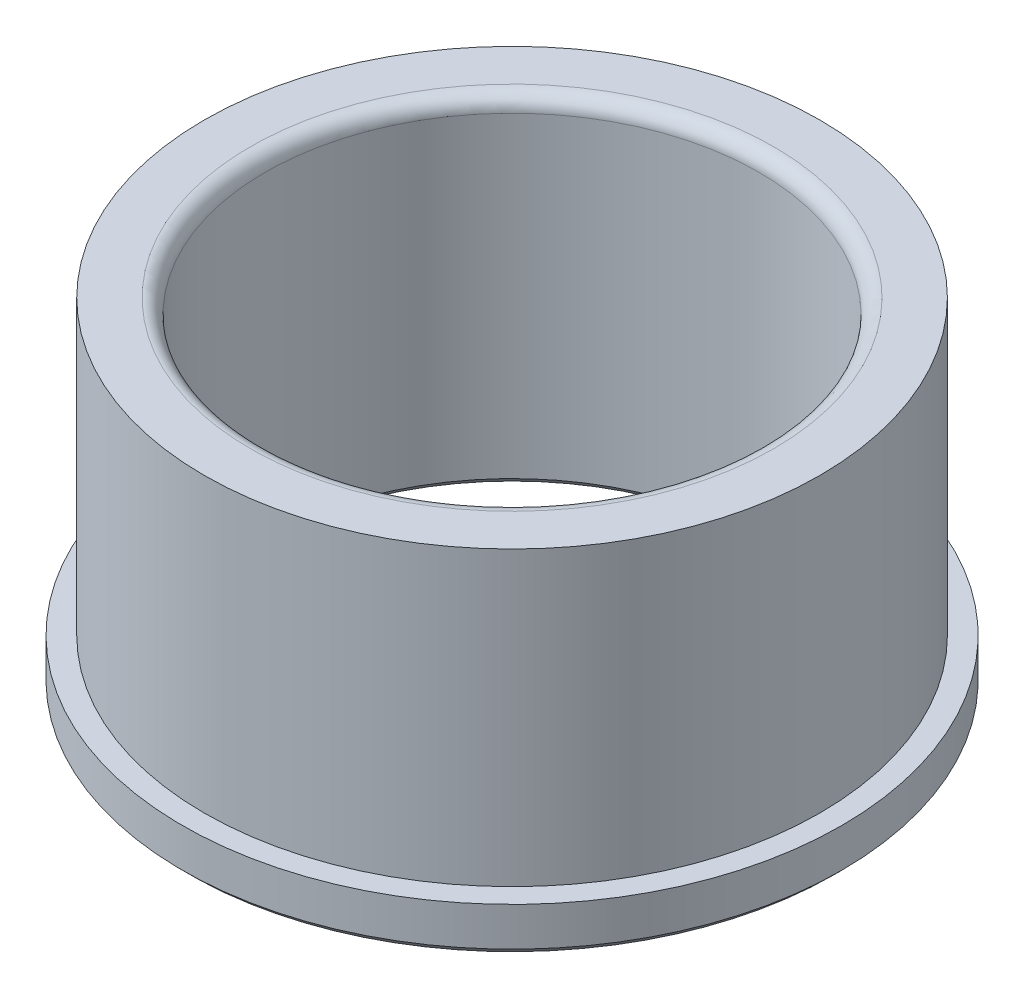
ISO-10303-21;
HEADER;
FILE_DESCRIPTION(('STEP AP214'),'2;1');
FILE_NAME('part.step','',(''),(''),'','','');
FILE_SCHEMA(('AUTOMOTIVE_DESIGN { 1 0 10303 214 1 1 1 1 }'));
ENDSEC;
DATA;
#1=APPLICATION_CONTEXT('core data for automotive mechanical design processes');
#2=APPLICATION_PROTOCOL_DEFINITION('international standard','automotive_design',2000,#1);
#3=PRODUCT_CONTEXT('',#1,'mechanical');
#4=PRODUCT('Part','Part','',(#3));
#5=PRODUCT_RELATED_PRODUCT_CATEGORY('part','',(#4));
#6=PRODUCT_DEFINITION_FORMATION('','',#4);
#7=PRODUCT_DEFINITION_CONTEXT('part definition',#1,'design');
#8=PRODUCT_DEFINITION('design','',#6,#7);
#9=PRODUCT_DEFINITION_SHAPE('','',#8);
#10=(LENGTH_UNIT() NAMED_UNIT(*) SI_UNIT(.MILLI.,.METRE.));
#11=(NAMED_UNIT(*) PLANE_ANGLE_UNIT() SI_UNIT($,.RADIAN.));
#12=(NAMED_UNIT(*) SI_UNIT($,.STERADIAN.) SOLID_ANGLE_UNIT());
#13=UNCERTAINTY_MEASURE_WITH_UNIT(LENGTH_MEASURE(1.E-05),#10,'distance_accuracy_value','');
#14=(GEOMETRIC_REPRESENTATION_CONTEXT(3) GLOBAL_UNCERTAINTY_ASSIGNED_CONTEXT((#13)) GLOBAL_UNIT_ASSIGNED_CONTEXT((#10,
#11,#12)) REPRESENTATION_CONTEXT('',''));
#15=CARTESIAN_POINT('',(0.,0.,0.));
#16=DIRECTION('',(0.,0.,1.));
#17=DIRECTION('',(1.,0.,0.));
#18=AXIS2_PLACEMENT_3D('',#15,#16,#17);
#19=CARTESIAN_POINT('',(3.49148336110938E-12,-1000.,0.));
#20=DIRECTION('',(0.,-1.,0.));
#21=DIRECTION('',(1.,0.,0.));
#22=AXIS2_PLACEMENT_3D('',#19,#20,#21);
#23=CYLINDRICAL_SURFACE('',#22,31.7563499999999);
#24=CARTESIAN_POINT('',(0.,4.7625,0.));
#25=DIRECTION('',(0.,-1.,0.));
#26=DIRECTION('',(1.,0.,0.));
#27=AXIS2_PLACEMENT_3D('',#24,#25,#26);
#28=CIRCLE('',#27,31.75635);
#29=CARTESIAN_POINT('',(31.75635,4.76250000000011,0.));
#30=VERTEX_POINT('',#29);
#31=EDGE_CURVE('E39',#30,#30,#28,.T.);
#32=ORIENTED_EDGE('',*,*,#31,.F.);
#33=EDGE_LOOP('',(#32));
#34=FACE_BOUND('',#33,.T.);
#35=CARTESIAN_POINT('',(-1.21940056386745E-13,34.9250000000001,0.));
#36=DIRECTION('',(0.,-1.,0.));
#37=DIRECTION('',(1.,0.,0.));
#38=AXIS2_PLACEMENT_3D('',#35,#36,#37);
#39=CIRCLE('',#38,31.7563499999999);
#40=CARTESIAN_POINT('',(31.7563499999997,34.9250000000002,0.));
#41=VERTEX_POINT('',#40);
#42=EDGE_CURVE('E60',#41,#41,#39,.T.);
#43=ORIENTED_EDGE('',*,*,#42,.T.);
#44=EDGE_LOOP('',(#43));
#45=FACE_BOUND('',#44,.T.);
#46=ADVANCED_FACE('F28',(#34,#45),#23,.T.);
#47=CARTESIAN_POINT('',(-33.9979,4.76249999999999,0.));
#48=DIRECTION('',(0.,-1.,0.));
#49=DIRECTION('',(1.,0.,0.));
#50=AXIS2_PLACEMENT_3D('',#47,#48,#49);
#51=PLANE('',#50);
#52=CARTESIAN_POINT('',(0.,4.76250000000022,0.));
#53=DIRECTION('',(0.,-1.,0.));
#54=DIRECTION('',(1.,0.,0.));
#55=AXIS2_PLACEMENT_3D('',#52,#53,#54);
#56=CIRCLE('',#55,33.9979);
#57=CARTESIAN_POINT('',(33.9979,4.76250000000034,0.));
#58=VERTEX_POINT('',#57);
#59=EDGE_CURVE('E43',#58,#58,#56,.T.);
#60=ORIENTED_EDGE('',*,*,#59,.F.);
#61=EDGE_LOOP('',(#60));
#62=FACE_BOUND('',#61,.T.);
#63=ORIENTED_EDGE('',*,*,#31,.T.);
#64=EDGE_LOOP('',(#63));
#65=FACE_BOUND('',#64,.T.);
#66=ADVANCED_FACE('F77',(#62,#65),#51,.F.);
#67=CARTESIAN_POINT('',(3.49148336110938E-12,-1000.,0.));
#68=DIRECTION('',(0.,-1.,0.));
#69=DIRECTION('',(1.,0.,0.));
#70=AXIS2_PLACEMENT_3D('',#67,#68,#69);
#71=CYLINDRICAL_SURFACE('',#70,33.9979);
#72=CARTESIAN_POINT('',(0.,0.762000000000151,0.));
#73=DIRECTION('',(0.,-1.,0.));
#74=DIRECTION('',(1.,0.,0.));
#75=AXIS2_PLACEMENT_3D('',#72,#73,#74);
#76=CIRCLE('',#75,33.9979);
#77=CARTESIAN_POINT('',(33.9979,0.76200000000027,0.));
#78=VERTEX_POINT('',#77);
#79=EDGE_CURVE('E48',#78,#78,#76,.T.);
#80=ORIENTED_EDGE('',*,*,#79,.F.);
#81=EDGE_LOOP('',(#80));
#82=FACE_BOUND('',#81,.T.);
#83=ORIENTED_EDGE('',*,*,#59,.T.);
#84=EDGE_LOOP('',(#83));
#85=FACE_BOUND('',#84,.T.);
#86=ADVANCED_FACE('F82',(#82,#85),#71,.T.);
#87=CARTESIAN_POINT('',(0.,0.762000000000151,0.));
#88=DIRECTION('',(0.,1.,0.));
#89=DIRECTION('',(-1.,0.,0.));
#90=AXIS2_PLACEMENT_3D('',#87,#88,#89);
#91=CONICAL_SURFACE('',#90,33.9979,0.785398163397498);
#92=CARTESIAN_POINT('',(0.,2.22044604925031E-13,0.));
#93=DIRECTION('',(0.,-1.,0.));
#94=DIRECTION('',(1.,0.,0.));
#95=AXIS2_PLACEMENT_3D('',#92,#93,#94);
#96=CIRCLE('',#95,33.2359);
#97=CARTESIAN_POINT('',(33.2359,3.38087196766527E-13,0.));
#98=VERTEX_POINT('',#97);
#99=EDGE_CURVE('E51',#98,#98,#96,.T.);
#100=ORIENTED_EDGE('',*,*,#99,.F.);
#101=EDGE_LOOP('',(#100));
#102=FACE_BOUND('',#101,.T.);
#103=ORIENTED_EDGE('',*,*,#79,.T.);
#104=EDGE_LOOP('',(#103));
#105=FACE_BOUND('',#104,.T.);
#106=ADVANCED_FACE('F89',(#102,#105),#91,.T.);
#107=CARTESIAN_POINT('',(-26.2255,0.,0.));
#108=DIRECTION('',(0.,1.,0.));
#109=DIRECTION('',(-1.,0.,0.));
#110=AXIS2_PLACEMENT_3D('',#107,#108,#109);
#111=PLANE('',#110);
#112=CARTESIAN_POINT('',(0.,0.,0.));
#113=DIRECTION('',(0.,-1.,0.));
#114=DIRECTION('',(1.,0.,0.));
#115=AXIS2_PLACEMENT_3D('',#112,#113,#114);
#116=CIRCLE('',#115,26.2255);
#117=CARTESIAN_POINT('',(26.2255,0.,0.));
#118=VERTEX_POINT('',#117);
#119=EDGE_CURVE('E54',#118,#118,#116,.T.);
#120=ORIENTED_EDGE('',*,*,#119,.F.);
#121=EDGE_LOOP('',(#120));
#122=FACE_BOUND('',#121,.T.);
#123=ORIENTED_EDGE('',*,*,#99,.T.);
#124=EDGE_LOOP('',(#123));
#125=FACE_BOUND('',#124,.T.);
#126=ADVANCED_FACE('F93',(#122,#125),#111,.F.);
#127=CARTESIAN_POINT('',(0.,0.,0.));
#128=DIRECTION('',(0.,-1.,0.));
#129=DIRECTION('',(1.,0.,0.));
#130=AXIS2_PLACEMENT_3D('',#127,#128,#129);
#131=CONICAL_SURFACE('',#130,26.2255,0.785398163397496);
#132=CARTESIAN_POINT('',(0.,0.761999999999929,0.));
#133=DIRECTION('',(0.,-1.,0.));
#134=DIRECTION('',(1.,0.,0.));
#135=AXIS2_PLACEMENT_3D('',#132,#133,#134);
#136=CIRCLE('',#135,25.4635);
#137=CARTESIAN_POINT('',(25.4635,0.762000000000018,0.));
#138=VERTEX_POINT('',#137);
#139=EDGE_CURVE('E57',#138,#138,#136,.T.);
#140=ORIENTED_EDGE('',*,*,#139,.F.);
#141=EDGE_LOOP('',(#140));
#142=FACE_BOUND('',#141,.T.);
#143=ORIENTED_EDGE('',*,*,#119,.T.);
#144=EDGE_LOOP('',(#143));
#145=FACE_BOUND('',#144,.T.);
#146=ADVANCED_FACE('F74',(#142,#145),#131,.F.);
#147=CARTESIAN_POINT('',(3.49148336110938E-12,-1000.,0.));
#148=DIRECTION('',(0.,-1.,0.));
#149=DIRECTION('',(1.,0.,0.));
#150=AXIS2_PLACEMENT_3D('',#147,#148,#149);
#151=CYLINDRICAL_SURFACE('',#150,25.4634999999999);
#152=CARTESIAN_POINT('',(-1.16619035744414E-13,33.401,0.));
#153=DIRECTION('',(0.,-1.,0.));
#154=DIRECTION('',(1.,0.,0.));
#155=AXIS2_PLACEMENT_3D('',#152,#153,#154);
#156=CIRCLE('',#155,25.4634999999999);
#157=CARTESIAN_POINT('',(25.4634999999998,33.4010000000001,0.));
#158=VERTEX_POINT('',#157);
#159=EDGE_CURVE('E10',#158,#158,#156,.F.);
#160=ORIENTED_EDGE('',*,*,#159,.T.);
#161=EDGE_LOOP('',(#160));
#162=FACE_BOUND('',#161,.T.);
#163=ORIENTED_EDGE('',*,*,#139,.T.);
#164=EDGE_LOOP('',(#163));
#165=FACE_BOUND('',#164,.T.);
#166=ADVANCED_FACE('F67',(#162,#165),#151,.F.);
#167=CARTESIAN_POINT('',(-31.75635,34.925,0.));
#168=DIRECTION('',(0.,-1.,0.));
#169=DIRECTION('',(1.,0.,0.));
#170=AXIS2_PLACEMENT_3D('',#167,#168,#169);
#171=PLANE('',#170);
#172=CARTESIAN_POINT('',(-1.21940056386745E-13,34.9250000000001,0.));
#173=DIRECTION('',(0.,-1.,0.));
#174=DIRECTION('',(1.,0.,0.));
#175=AXIS2_PLACEMENT_3D('',#172,#173,#174);
#176=CIRCLE('',#175,26.9874999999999);
#177=CARTESIAN_POINT('',(26.9874999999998,34.9250000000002,0.));
#178=VERTEX_POINT('',#177);
#179=EDGE_CURVE('E35',#178,#178,#176,.T.);
#180=ORIENTED_EDGE('',*,*,#179,.T.);
#181=EDGE_LOOP('',(#180));
#182=FACE_BOUND('',#181,.T.);
#183=ORIENTED_EDGE('',*,*,#42,.F.);
#184=EDGE_LOOP('',(#183));
#185=FACE_BOUND('',#184,.T.);
#186=ADVANCED_FACE('F65',(#182,#185),#171,.F.);
#187=CARTESIAN_POINT('',(-1.16619035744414E-13,33.401,0.));
#188=DIRECTION('',(0.,-1.,0.));
#189=DIRECTION('',(1.,0.,0.));
#190=AXIS2_PLACEMENT_3D('',#187,#188,#189);
#191=TOROIDAL_SURFACE('',#190,26.9874999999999,1.524);
#192=ORIENTED_EDGE('',*,*,#159,.F.);
#193=EDGE_LOOP('',(#192));
#194=FACE_BOUND('',#193,.T.);
#195=ORIENTED_EDGE('',*,*,#179,.F.);
#196=EDGE_LOOP('',(#195));
#197=FACE_BOUND('',#196,.T.);
#198=ADVANCED_FACE('F30',(#194,#197),#191,.T.);
#199=CLOSED_SHELL('',(#46,#66,#86,#106,#126,#146,#166,#186,#198));
#200=MANIFOLD_SOLID_BREP('B2',#199);
#201=ADVANCED_BREP_SHAPE_REPRESENTATION('',(#18,#200),#14);
#202=SHAPE_DEFINITION_REPRESENTATION(#9,#201);
ENDSEC;
END-ISO-10303-21;
